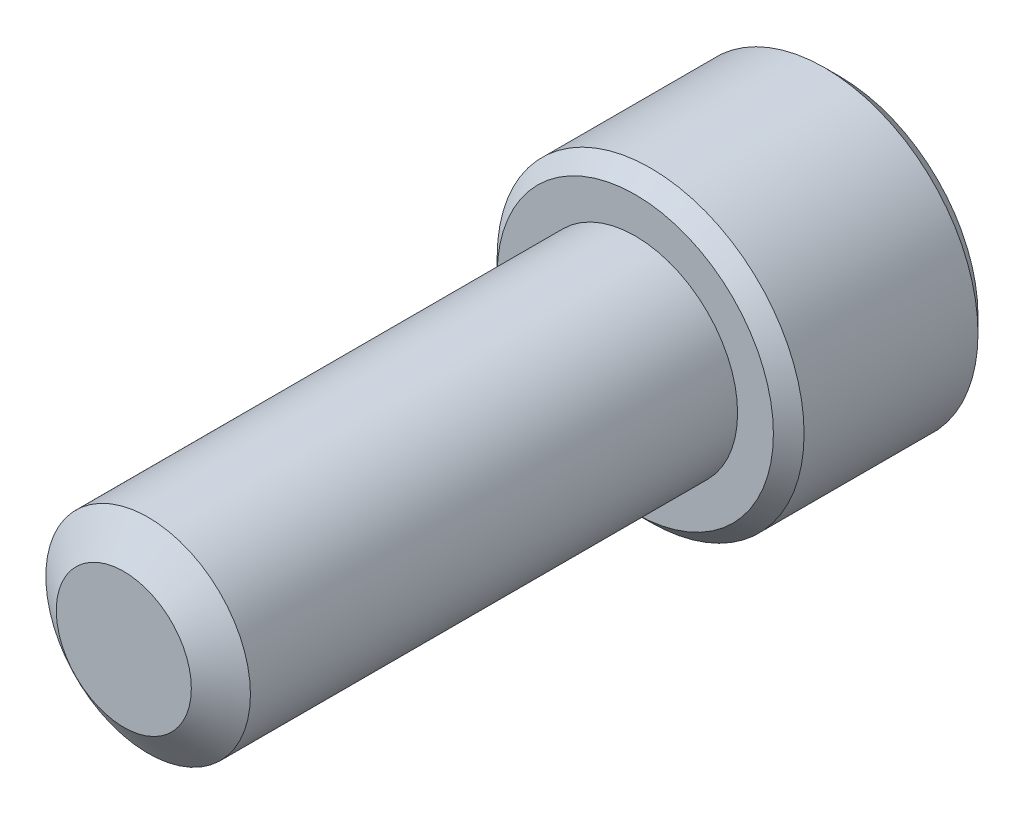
from build123d import *

# Parameters (mm, degrees)
SKETCH1_R          = 3.175
EXTRUDE1_DEPTH     = 15.875
SKETCH6_R          = 4.7625
EXTRUDE2_DEPTH     = 6.35
CUT_EXTRUDE1_DEPTH = 3.571875
CHAMFER1_SIZE      = 0.47625


with BuildPart() as part:
    # Sketch1 → Extrude1 (new body)
    with BuildSketch(Plane.XY):
        Circle(SKETCH1_R)
    extrude(amount=-EXTRUDE1_DEPTH)

    # Sketch4 → Cut-Revolve1 (revolve, cut)
    with BuildSketch(Plane(origin=(0, 0, 0), x_dir=(0, 0, -1), z_dir=(1, 0, 0)), mode=Mode.PRIVATE) as cut_revolve1_sk:
        Polygon((0.755446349, 3.175), (0, 2.096110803), (0, 3.175), align=None)
    revolve(cut_revolve1_sk.sketch.rotate(Axis((0, 0, 0), (0, 0, -1)), 90), axis=Axis((0, 0, 0), (0, 0, -1)), mode=Mode.SUBTRACT)

    # Sketch6 → Extrude2 (add)
    with BuildSketch(Plane(origin=(0, 0, -15.875), x_dir=(-1, 0, 0), z_dir=(0, 0, -1))):
        Circle(SKETCH6_R)
    extrude(amount=EXTRUDE2_DEPTH)

    # Sketch7 → Cut-Extrude1 (cut)
    with BuildSketch(Plane(origin=(0, 0, -22.225), x_dir=(-1, 0, 0), z_dir=(0, 0, -1))):
        Polygon((0, 2.749630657), (-2.38125, 1.374815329), (-2.38125, -1.374815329), (0, -2.749630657), (2.38125, -1.374815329), (2.38125, 1.374815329), align=None)
    extrude(amount=-CUT_EXTRUDE1_DEPTH, mode=Mode.SUBTRACT)

    # Cut-Extrude2 cone 1 section (on through the dimple's axis) → Cut-Extrude2 (revolve, cut)
    with BuildSketch(Plane(origin=(0, 0, -22.225), x_dir=(0, 1, 0), z_dir=(1, 0, 0))):
        Polygon((0, 0), (2.749630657, 0), (0, 2.749630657), align=None)
    revolve(axis=Axis((0, 0, -22.225), (0, 0, 1)), mode=Mode.SUBTRACT)

    # Chamfer1
    chamfer1_edges = [part.edges().sort_by_distance(p)[0] for p in [
        (4.7625, 0, -15.875),
        (4.7625, 0, -22.225),
    ]]
    chamfer(chamfer1_edges, length=CHAMFER1_SIZE)


solid = part.part
